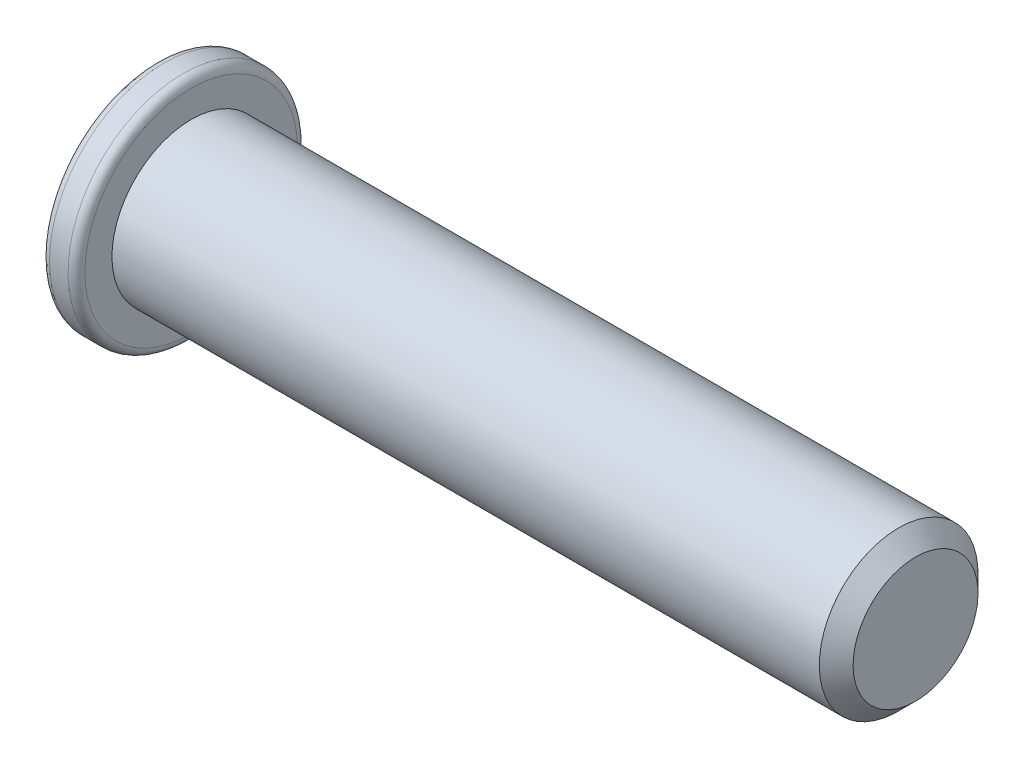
ISO-10303-21;
HEADER;
FILE_DESCRIPTION(('STEP AP214'),'2;1');
FILE_NAME('part.step','',(''),(''),'','','');
FILE_SCHEMA(('AUTOMOTIVE_DESIGN { 1 0 10303 214 1 1 1 1 }'));
ENDSEC;
DATA;
#1=APPLICATION_CONTEXT('core data for automotive mechanical design processes');
#2=APPLICATION_PROTOCOL_DEFINITION('international standard','automotive_design',2000,#1);
#3=PRODUCT_CONTEXT('',#1,'mechanical');
#4=PRODUCT('Part','Part','',(#3));
#5=PRODUCT_RELATED_PRODUCT_CATEGORY('part','',(#4));
#6=PRODUCT_DEFINITION_FORMATION('','',#4);
#7=PRODUCT_DEFINITION_CONTEXT('part definition',#1,'design');
#8=PRODUCT_DEFINITION('design','',#6,#7);
#9=PRODUCT_DEFINITION_SHAPE('','',#8);
#10=(LENGTH_UNIT() NAMED_UNIT(*) SI_UNIT(.MILLI.,.METRE.));
#11=(NAMED_UNIT(*) PLANE_ANGLE_UNIT() SI_UNIT($,.RADIAN.));
#12=(NAMED_UNIT(*) SI_UNIT($,.STERADIAN.) SOLID_ANGLE_UNIT());
#13=UNCERTAINTY_MEASURE_WITH_UNIT(LENGTH_MEASURE(1.E-05),#10,'distance_accuracy_value','');
#14=(GEOMETRIC_REPRESENTATION_CONTEXT(3) GLOBAL_UNCERTAINTY_ASSIGNED_CONTEXT((#13)) GLOBAL_UNIT_ASSIGNED_CONTEXT((#10,
#11,#12)) REPRESENTATION_CONTEXT('',''));
#15=CARTESIAN_POINT('',(0.,0.,0.));
#16=DIRECTION('',(0.,0.,1.));
#17=DIRECTION('',(1.,0.,0.));
#18=AXIS2_PLACEMENT_3D('',#15,#16,#17);
#19=CARTESIAN_POINT('',(0.,0.,0.));
#20=DIRECTION('',(-1.,0.,0.));
#21=DIRECTION('',(0.,-1.,0.));
#22=AXIS2_PLACEMENT_3D('',#19,#20,#21);
#23=PLANE('',#22);
#24=CARTESIAN_POINT('',(0.,0.,0.));
#25=DIRECTION('',(-1.,0.,0.));
#26=DIRECTION('',(0.,-1.,0.));
#27=AXIS2_PLACEMENT_3D('',#24,#25,#26);
#28=CIRCLE('',#27,6.3);
#29=CARTESIAN_POINT('',(0.,-6.3,0.));
#30=VERTEX_POINT('',#29);
#31=EDGE_CURVE('E10',#30,#30,#28,.T.);
#32=ORIENTED_EDGE('',*,*,#31,.T.);
#33=EDGE_LOOP('',(#32));
#34=FACE_BOUND('',#33,.T.);
#35=ADVANCED_FACE('F32',(#34),#23,.T.);
#36=CARTESIAN_POINT('',(45.,0.,0.));
#37=DIRECTION('',(1.,0.,0.));
#38=DIRECTION('',(0.,1.,0.));
#39=AXIS2_PLACEMENT_3D('',#36,#37,#38);
#40=CYLINDRICAL_SURFACE('',#39,6.8);
#41=CARTESIAN_POINT('',(1.6,0.,0.));
#42=DIRECTION('',(1.,0.,0.));
#43=DIRECTION('',(0.,1.,0.));
#44=AXIS2_PLACEMENT_3D('',#41,#42,#43);
#45=CIRCLE('',#44,6.8);
#46=CARTESIAN_POINT('',(1.6,6.8,0.));
#47=VERTEX_POINT('',#46);
#48=EDGE_CURVE('E39',#47,#47,#45,.F.);
#49=ORIENTED_EDGE('',*,*,#48,.T.);
#50=EDGE_LOOP('',(#49));
#51=FACE_BOUND('',#50,.T.);
#52=CARTESIAN_POINT('',(0.5,0.,0.));
#53=DIRECTION('',(-1.,0.,0.));
#54=DIRECTION('',(0.,-1.,0.));
#55=AXIS2_PLACEMENT_3D('',#52,#53,#54);
#56=CIRCLE('',#55,6.8);
#57=CARTESIAN_POINT('',(0.499999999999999,-6.8,0.));
#58=VERTEX_POINT('',#57);
#59=EDGE_CURVE('E43',#58,#58,#56,.F.);
#60=ORIENTED_EDGE('',*,*,#59,.T.);
#61=EDGE_LOOP('',(#60));
#62=FACE_BOUND('',#61,.T.);
#63=ADVANCED_FACE('F66',(#51,#62),#40,.T.);
#64=CARTESIAN_POINT('',(2.1,6.8,0.));
#65=DIRECTION('',(1.,0.,0.));
#66=DIRECTION('',(0.,1.,0.));
#67=AXIS2_PLACEMENT_3D('',#64,#65,#66);
#68=PLANE('',#67);
#69=CARTESIAN_POINT('',(2.1,0.,0.));
#70=DIRECTION('',(1.,0.,0.));
#71=DIRECTION('',(0.,1.,0.));
#72=AXIS2_PLACEMENT_3D('',#69,#70,#71);
#73=CIRCLE('',#72,6.3);
#74=CARTESIAN_POINT('',(2.1,6.3,0.));
#75=VERTEX_POINT('',#74);
#76=EDGE_CURVE('E47',#75,#75,#73,.T.);
#77=ORIENTED_EDGE('',*,*,#76,.T.);
#78=EDGE_LOOP('',(#77));
#79=FACE_BOUND('',#78,.T.);
#80=CARTESIAN_POINT('',(2.1,0.,0.));
#81=DIRECTION('',(1.,0.,0.));
#82=DIRECTION('',(0.,1.,0.));
#83=AXIS2_PLACEMENT_3D('',#80,#81,#82);
#84=CIRCLE('',#83,4.7);
#85=CARTESIAN_POINT('',(2.1,4.7,0.));
#86=VERTEX_POINT('',#85);
#87=EDGE_CURVE('E58',#86,#86,#84,.T.);
#88=ORIENTED_EDGE('',*,*,#87,.F.);
#89=EDGE_LOOP('',(#88));
#90=FACE_BOUND('',#89,.T.);
#91=ADVANCED_FACE('F64',(#79,#90),#68,.T.);
#92=CARTESIAN_POINT('',(45.,0.,0.));
#93=DIRECTION('',(1.,0.,0.));
#94=DIRECTION('',(0.,1.,0.));
#95=AXIS2_PLACEMENT_3D('',#92,#93,#94);
#96=CYLINDRICAL_SURFACE('',#95,4.7);
#97=CARTESIAN_POINT('',(44.,0.,0.));
#98=DIRECTION('',(1.,0.,0.));
#99=DIRECTION('',(0.,1.,0.));
#100=AXIS2_PLACEMENT_3D('',#97,#98,#99);
#101=CIRCLE('',#100,4.7);
#102=CARTESIAN_POINT('',(44.,4.7,0.));
#103=VERTEX_POINT('',#102);
#104=EDGE_CURVE('E52',#103,#103,#101,.F.);
#105=ORIENTED_EDGE('',*,*,#104,.T.);
#106=EDGE_LOOP('',(#105));
#107=FACE_BOUND('',#106,.T.);
#108=ORIENTED_EDGE('',*,*,#87,.T.);
#109=EDGE_LOOP('',(#108));
#110=FACE_BOUND('',#109,.T.);
#111=ADVANCED_FACE('F62',(#107,#110),#96,.T.);
#112=CARTESIAN_POINT('',(45.,4.7,0.));
#113=DIRECTION('',(1.,0.,0.));
#114=DIRECTION('',(0.,1.,0.));
#115=AXIS2_PLACEMENT_3D('',#112,#113,#114);
#116=PLANE('',#115);
#117=CARTESIAN_POINT('',(45.,0.,0.));
#118=DIRECTION('',(1.,0.,0.));
#119=DIRECTION('',(0.,1.,0.));
#120=AXIS2_PLACEMENT_3D('',#117,#118,#119);
#121=CIRCLE('',#120,3.7);
#122=CARTESIAN_POINT('',(45.,3.7,0.));
#123=VERTEX_POINT('',#122);
#124=EDGE_CURVE('E55',#123,#123,#121,.T.);
#125=ORIENTED_EDGE('',*,*,#124,.T.);
#126=EDGE_LOOP('',(#125));
#127=FACE_BOUND('',#126,.T.);
#128=ADVANCED_FACE('F74',(#127),#116,.T.);
#129=CARTESIAN_POINT('',(45.,0.,0.));
#130=DIRECTION('',(-1.,0.,0.));
#131=DIRECTION('',(0.,-1.,0.));
#132=AXIS2_PLACEMENT_3D('',#129,#130,#131);
#133=CONICAL_SURFACE('',#132,3.7,0.785398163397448);
#134=ORIENTED_EDGE('',*,*,#104,.F.);
#135=EDGE_LOOP('',(#134));
#136=FACE_BOUND('',#135,.T.);
#137=ORIENTED_EDGE('',*,*,#124,.F.);
#138=EDGE_LOOP('',(#137));
#139=FACE_BOUND('',#138,.T.);
#140=ADVANCED_FACE('F83',(#136,#139),#133,.T.);
#141=CARTESIAN_POINT('',(1.6,0.,0.));
#142=DIRECTION('',(1.,0.,0.));
#143=DIRECTION('',(0.,1.,0.));
#144=AXIS2_PLACEMENT_3D('',#141,#142,#143);
#145=TOROIDAL_SURFACE('',#144,6.3,0.5);
#146=ORIENTED_EDGE('',*,*,#48,.F.);
#147=EDGE_LOOP('',(#146));
#148=FACE_BOUND('',#147,.T.);
#149=ORIENTED_EDGE('',*,*,#76,.F.);
#150=EDGE_LOOP('',(#149));
#151=FACE_BOUND('',#150,.T.);
#152=ADVANCED_FACE('F85',(#148,#151),#145,.T.);
#153=CARTESIAN_POINT('',(0.5,0.,0.));
#154=DIRECTION('',(-1.,0.,0.));
#155=DIRECTION('',(0.,-1.,0.));
#156=AXIS2_PLACEMENT_3D('',#153,#154,#155);
#157=TOROIDAL_SURFACE('',#156,6.3,0.5);
#158=ORIENTED_EDGE('',*,*,#31,.F.);
#159=EDGE_LOOP('',(#158));
#160=FACE_BOUND('',#159,.T.);
#161=ORIENTED_EDGE('',*,*,#59,.F.);
#162=EDGE_LOOP('',(#161));
#163=FACE_BOUND('',#162,.T.);
#164=ADVANCED_FACE('F34',(#160,#163),#157,.T.);
#165=CLOSED_SHELL('',(#35,#63,#91,#111,#128,#140,#152,#164));
#166=MANIFOLD_SOLID_BREP('B2',#165);
#167=ADVANCED_BREP_SHAPE_REPRESENTATION('',(#18,#166),#14);
#168=SHAPE_DEFINITION_REPRESENTATION(#9,#167);
ENDSEC;
END-ISO-10303-21;
